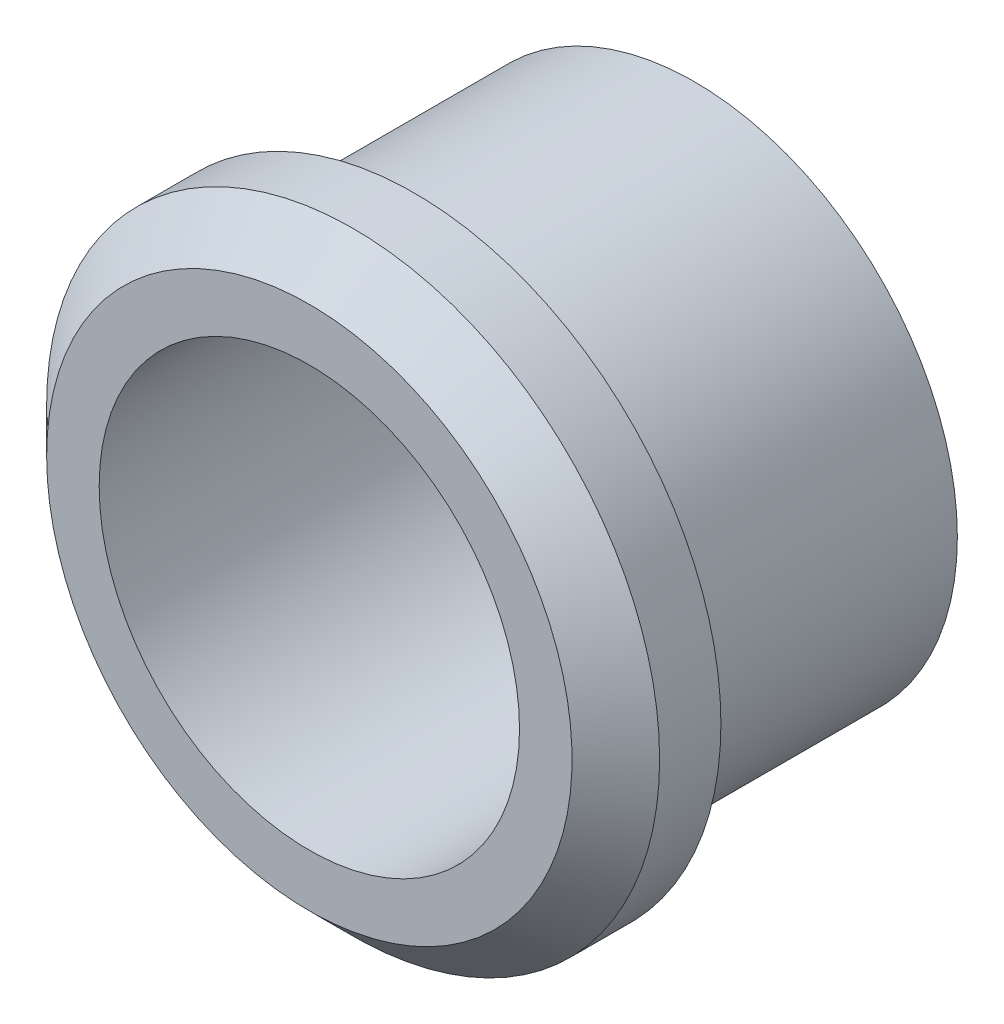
ISO-10303-21;
HEADER;
FILE_DESCRIPTION(('STEP AP214'),'2;1');
FILE_NAME('part.step','',(''),(''),'','','');
FILE_SCHEMA(('AUTOMOTIVE_DESIGN { 1 0 10303 214 1 1 1 1 }'));
ENDSEC;
DATA;
#1=APPLICATION_CONTEXT('core data for automotive mechanical design processes');
#2=APPLICATION_PROTOCOL_DEFINITION('international standard','automotive_design',2000,#1);
#3=PRODUCT_CONTEXT('',#1,'mechanical');
#4=PRODUCT('Part','Part','',(#3));
#5=PRODUCT_RELATED_PRODUCT_CATEGORY('part','',(#4));
#6=PRODUCT_DEFINITION_FORMATION('','',#4);
#7=PRODUCT_DEFINITION_CONTEXT('part definition',#1,'design');
#8=PRODUCT_DEFINITION('design','',#6,#7);
#9=PRODUCT_DEFINITION_SHAPE('','',#8);
#10=(LENGTH_UNIT() NAMED_UNIT(*) SI_UNIT(.MILLI.,.METRE.));
#11=(NAMED_UNIT(*) PLANE_ANGLE_UNIT() SI_UNIT($,.RADIAN.));
#12=(NAMED_UNIT(*) SI_UNIT($,.STERADIAN.) SOLID_ANGLE_UNIT());
#13=UNCERTAINTY_MEASURE_WITH_UNIT(LENGTH_MEASURE(1.E-05),#10,'distance_accuracy_value','');
#14=(GEOMETRIC_REPRESENTATION_CONTEXT(3) GLOBAL_UNCERTAINTY_ASSIGNED_CONTEXT((#13)) GLOBAL_UNIT_ASSIGNED_CONTEXT((#10,
#11,#12)) REPRESENTATION_CONTEXT('',''));
#15=CARTESIAN_POINT('',(0.,0.,0.));
#16=DIRECTION('',(0.,0.,1.));
#17=DIRECTION('',(1.,0.,0.));
#18=AXIS2_PLACEMENT_3D('',#15,#16,#17);
#19=CARTESIAN_POINT('',(0.,0.,11.));
#20=DIRECTION('',(0.,0.,1.));
#21=DIRECTION('',(1.,0.,0.));
#22=AXIS2_PLACEMENT_3D('',#19,#20,#21);
#23=CYLINDRICAL_SURFACE('',#22,17.5);
#24=CARTESIAN_POINT('',(0.,0.,19.4999999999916));
#25=DIRECTION('',(0.,0.,-1.));
#26=DIRECTION('',(-0.479425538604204,0.877582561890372,0.));
#27=AXIS2_PLACEMENT_3D('',#24,#25,#26);
#28=CIRCLE('',#27,17.5000000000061);
#29=CARTESIAN_POINT('',(-8.38994692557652,15.3576948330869,19.4999999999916));
#30=VERTEX_POINT('',#29);
#31=EDGE_CURVE('E38',#30,#30,#28,.F.);
#32=ORIENTED_EDGE('',*,*,#31,.F.);
#33=EDGE_LOOP('',(#32));
#34=FACE_BOUND('',#33,.T.);
#35=CARTESIAN_POINT('',(0.,0.,16.));
#36=DIRECTION('',(0.,0.,1.));
#37=DIRECTION('',(1.,0.,0.));
#38=AXIS2_PLACEMENT_3D('',#35,#36,#37);
#39=CIRCLE('',#38,17.5);
#40=CARTESIAN_POINT('',(17.5,0.,16.));
#41=VERTEX_POINT('',#40);
#42=EDGE_CURVE('E26',#41,#41,#39,.T.);
#43=ORIENTED_EDGE('',*,*,#42,.T.);
#44=EDGE_LOOP('',(#43));
#45=FACE_BOUND('',#44,.T.);
#46=ADVANCED_FACE('F22',(#34,#45),#23,.T.);
#47=CARTESIAN_POINT('',(0.,15.,16.));
#48=DIRECTION('',(0.,0.,1.));
#49=DIRECTION('',(1.,0.,0.));
#50=AXIS2_PLACEMENT_3D('',#47,#48,#49);
#51=PLANE('',#50);
#52=CARTESIAN_POINT('',(0.,0.,16.));
#53=DIRECTION('',(0.,0.,1.));
#54=DIRECTION('',(1.,0.,0.));
#55=AXIS2_PLACEMENT_3D('',#52,#53,#54);
#56=CIRCLE('',#55,15.);
#57=CARTESIAN_POINT('',(15.,0.,16.));
#58=VERTEX_POINT('',#57);
#59=EDGE_CURVE('E44',#58,#58,#56,.F.);
#60=ORIENTED_EDGE('',*,*,#59,.F.);
#61=EDGE_LOOP('',(#60));
#62=FACE_BOUND('',#61,.T.);
#63=ORIENTED_EDGE('',*,*,#42,.F.);
#64=EDGE_LOOP('',(#63));
#65=FACE_BOUND('',#64,.T.);
#66=ADVANCED_FACE('F55',(#62,#65),#51,.F.);
#67=CARTESIAN_POINT('',(0.,0.,19.4999999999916));
#68=DIRECTION('',(0.,0.,-1.));
#69=DIRECTION('',(-1.,0.,0.));
#70=AXIS2_PLACEMENT_3D('',#67,#68,#69);
#71=CONICAL_SURFACE('',#70,17.5000000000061,0.785398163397);
#72=CARTESIAN_POINT('',(0.,0.,21.9999999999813));
#73=DIRECTION('',(0.,0.,-1.));
#74=DIRECTION('',(-1.,0.,0.));
#75=AXIS2_PLACEMENT_3D('',#72,#73,#74);
#76=CIRCLE('',#75,15.0000000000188);
#77=CARTESIAN_POINT('',(-15.0000000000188,0.,21.9999999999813));
#78=VERTEX_POINT('',#77);
#79=EDGE_CURVE('E42',#78,#78,#76,.F.);
#80=ORIENTED_EDGE('',*,*,#79,.F.);
#81=EDGE_LOOP('',(#80));
#82=FACE_BOUND('',#81,.T.);
#83=ORIENTED_EDGE('',*,*,#31,.T.);
#84=EDGE_LOOP('',(#83));
#85=FACE_BOUND('',#84,.T.);
#86=ADVANCED_FACE('F57',(#82,#85),#71,.T.);
#87=CARTESIAN_POINT('',(0.,0.,11.));
#88=DIRECTION('',(0.,0.,1.));
#89=DIRECTION('',(1.,0.,0.));
#90=AXIS2_PLACEMENT_3D('',#87,#88,#89);
#91=CYLINDRICAL_SURFACE('',#90,15.);
#92=ORIENTED_EDGE('',*,*,#59,.T.);
#93=EDGE_LOOP('',(#92));
#94=FACE_BOUND('',#93,.T.);
#95=CARTESIAN_POINT('',(0.,0.,0.));
#96=DIRECTION('',(0.,0.,1.));
#97=DIRECTION('',(1.,0.,0.));
#98=AXIS2_PLACEMENT_3D('',#95,#96,#97);
#99=CIRCLE('',#98,15.);
#100=CARTESIAN_POINT('',(15.,0.,0.));
#101=VERTEX_POINT('',#100);
#102=EDGE_CURVE('E35',#101,#101,#99,.T.);
#103=ORIENTED_EDGE('',*,*,#102,.T.);
#104=EDGE_LOOP('',(#103));
#105=FACE_BOUND('',#104,.T.);
#106=ADVANCED_FACE('F65',(#94,#105),#91,.T.);
#107=CARTESIAN_POINT('',(0.,15.,22.));
#108=DIRECTION('',(0.,0.,1.));
#109=DIRECTION('',(1.,0.,0.));
#110=AXIS2_PLACEMENT_3D('',#107,#108,#109);
#111=PLANE('',#110);
#112=CARTESIAN_POINT('',(0.,0.,22.));
#113=DIRECTION('',(0.,0.,1.));
#114=DIRECTION('',(1.,0.,0.));
#115=AXIS2_PLACEMENT_3D('',#112,#113,#114);
#116=CIRCLE('',#115,12.);
#117=CARTESIAN_POINT('',(12.,0.,22.));
#118=VERTEX_POINT('',#117);
#119=EDGE_CURVE('E30',#118,#118,#116,.F.);
#120=ORIENTED_EDGE('',*,*,#119,.T.);
#121=EDGE_LOOP('',(#120));
#122=FACE_BOUND('',#121,.T.);
#123=ORIENTED_EDGE('',*,*,#79,.T.);
#124=EDGE_LOOP('',(#123));
#125=FACE_BOUND('',#124,.T.);
#126=ADVANCED_FACE('F76',(#122,#125),#111,.T.);
#127=CARTESIAN_POINT('',(0.,12.,0.));
#128=DIRECTION('',(0.,0.,1.));
#129=DIRECTION('',(1.,0.,0.));
#130=AXIS2_PLACEMENT_3D('',#127,#128,#129);
#131=PLANE('',#130);
#132=CARTESIAN_POINT('',(0.,0.,0.));
#133=DIRECTION('',(0.,0.,1.));
#134=DIRECTION('',(1.,0.,0.));
#135=AXIS2_PLACEMENT_3D('',#132,#133,#134);
#136=CIRCLE('',#135,12.);
#137=CARTESIAN_POINT('',(12.,0.,0.));
#138=VERTEX_POINT('',#137);
#139=EDGE_CURVE('E12',#138,#138,#136,.T.);
#140=ORIENTED_EDGE('',*,*,#139,.T.);
#141=EDGE_LOOP('',(#140));
#142=FACE_BOUND('',#141,.T.);
#143=ORIENTED_EDGE('',*,*,#102,.F.);
#144=EDGE_LOOP('',(#143));
#145=FACE_BOUND('',#144,.T.);
#146=ADVANCED_FACE('F71',(#142,#145),#131,.F.);
#147=CARTESIAN_POINT('',(0.,0.,11.));
#148=DIRECTION('',(0.,0.,1.));
#149=DIRECTION('',(1.,0.,0.));
#150=AXIS2_PLACEMENT_3D('',#147,#148,#149);
#151=CYLINDRICAL_SURFACE('',#150,12.);
#152=ORIENTED_EDGE('',*,*,#139,.F.);
#153=EDGE_LOOP('',(#152));
#154=FACE_BOUND('',#153,.T.);
#155=ORIENTED_EDGE('',*,*,#119,.F.);
#156=EDGE_LOOP('',(#155));
#157=FACE_BOUND('',#156,.T.);
#158=ADVANCED_FACE('F24',(#154,#157),#151,.F.);
#159=CLOSED_SHELL('',(#46,#66,#86,#106,#126,#146,#158));
#160=MANIFOLD_SOLID_BREP('B1',#159);
#161=ADVANCED_BREP_SHAPE_REPRESENTATION('',(#18,#160),#14);
#162=SHAPE_DEFINITION_REPRESENTATION(#9,#161);
ENDSEC;
END-ISO-10303-21;
